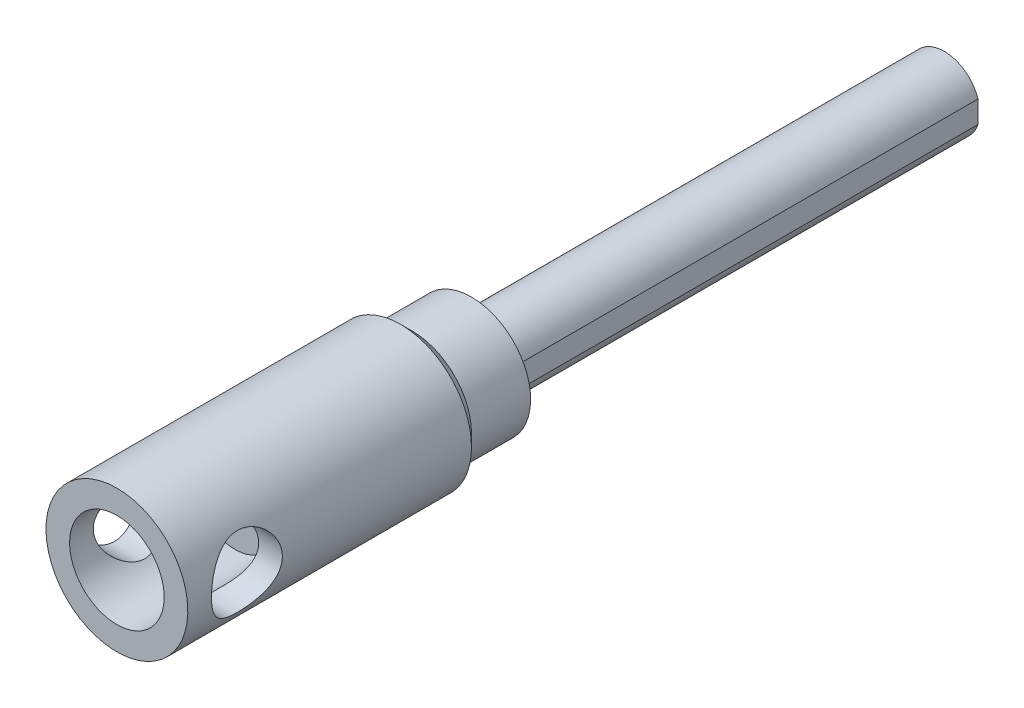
ISO-10303-21;
HEADER;
FILE_DESCRIPTION(('STEP AP214'),'2;1');
FILE_NAME('part.step','',(''),(''),'','','');
FILE_SCHEMA(('AUTOMOTIVE_DESIGN { 1 0 10303 214 1 1 1 1 }'));
ENDSEC;
DATA;
#1=APPLICATION_CONTEXT('core data for automotive mechanical design processes');
#2=APPLICATION_PROTOCOL_DEFINITION('international standard','automotive_design',2000,#1);
#3=PRODUCT_CONTEXT('',#1,'mechanical');
#4=PRODUCT('Part','Part','',(#3));
#5=PRODUCT_RELATED_PRODUCT_CATEGORY('part','',(#4));
#6=PRODUCT_DEFINITION_FORMATION('','',#4);
#7=PRODUCT_DEFINITION_CONTEXT('part definition',#1,'design');
#8=PRODUCT_DEFINITION('design','',#6,#7);
#9=PRODUCT_DEFINITION_SHAPE('','',#8);
#10=(LENGTH_UNIT() NAMED_UNIT(*) SI_UNIT(.MILLI.,.METRE.));
#11=(NAMED_UNIT(*) PLANE_ANGLE_UNIT() SI_UNIT($,.RADIAN.));
#12=(NAMED_UNIT(*) SI_UNIT($,.STERADIAN.) SOLID_ANGLE_UNIT());
#13=UNCERTAINTY_MEASURE_WITH_UNIT(LENGTH_MEASURE(1.E-05),#10,'distance_accuracy_value','');
#14=(GEOMETRIC_REPRESENTATION_CONTEXT(3) GLOBAL_UNCERTAINTY_ASSIGNED_CONTEXT((#13)) GLOBAL_UNIT_ASSIGNED_CONTEXT((#10,
#11,#12)) REPRESENTATION_CONTEXT('',''));
#15=CARTESIAN_POINT('',(0.,0.,0.));
#16=DIRECTION('',(0.,0.,1.));
#17=DIRECTION('',(1.,0.,0.));
#18=AXIS2_PLACEMENT_3D('',#15,#16,#17);
#19=CARTESIAN_POINT('',(-1.73205080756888,8.40265377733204E-13,58.));
#20=DIRECTION('',(0.866025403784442,-0.5,0.));
#21=DIRECTION('',(0.5,0.866025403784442,0.));
#22=AXIS2_PLACEMENT_3D('',#19,#20,#21);
#23=PLANE('',#22);
#24=DIRECTION('',(0.,0.,1.));
#25=VECTOR('',#24,1.);
#26=CARTESIAN_POINT('',(-0.866025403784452,1.50000000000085,58.));
#27=LINE('',#26,#25);
#28=CARTESIAN_POINT('',(-0.866025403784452,1.50000000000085,58.));
#29=VERTEX_POINT('',#28);
#30=CARTESIAN_POINT('',(-0.866025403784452,1.50000000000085,60.));
#31=VERTEX_POINT('',#30);
#32=EDGE_CURVE('E257',#29,#31,#27,.T.);
#33=ORIENTED_EDGE('',*,*,#32,.T.);
#34=DIRECTION('',(0.5,0.866025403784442,0.));
#35=VECTOR('',#34,1.);
#36=CARTESIAN_POINT('',(-1.73205080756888,8.4049667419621E-13,60.));
#37=LINE('',#36,#35);
#38=CARTESIAN_POINT('',(-1.73205080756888,8.4060509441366E-13,60.));
#39=VERTEX_POINT('',#38);
#40=EDGE_CURVE('E29',#39,#31,#37,.T.);
#41=ORIENTED_EDGE('',*,*,#40,.F.);
#42=DIRECTION('',(0.,0.,1.));
#43=VECTOR('',#42,1.);
#44=CARTESIAN_POINT('',(-1.73205080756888,8.40265377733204E-13,58.));
#45=LINE('',#44,#43);
#46=CARTESIAN_POINT('',(-1.73205080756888,8.40265377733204E-13,58.));
#47=VERTEX_POINT('',#46);
#48=EDGE_CURVE('E33',#47,#39,#45,.T.);
#49=ORIENTED_EDGE('',*,*,#48,.F.);
#50=DIRECTION('',(0.5,0.866025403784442,0.));
#51=VECTOR('',#50,1.);
#52=CARTESIAN_POINT('',(-1.73205080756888,8.40265377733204E-13,58.));
#53=LINE('',#52,#51);
#54=EDGE_CURVE('E218',#47,#29,#53,.T.);
#55=ORIENTED_EDGE('',*,*,#54,.T.);
#56=EDGE_LOOP('',(#33,#41,#49,#55));
#57=FACE_BOUND('',#56,.T.);
#58=ADVANCED_FACE('F14',(#57),#23,.T.);
#59=CARTESIAN_POINT('',(0.86602540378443,1.50000000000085,58.));
#60=DIRECTION('',(0.,1.,0.));
#61=DIRECTION('',(-1.,0.,0.));
#62=AXIS2_PLACEMENT_3D('',#59,#60,#61);
#63=PLANE('',#62);
#64=DIRECTION('',(0.,0.,1.));
#65=VECTOR('',#64,1.);
#66=CARTESIAN_POINT('',(0.86602540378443,1.50000000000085,58.));
#67=LINE('',#66,#65);
#68=CARTESIAN_POINT('',(0.86602540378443,1.50000000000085,58.));
#69=VERTEX_POINT('',#68);
#70=CARTESIAN_POINT('',(0.86602540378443,1.50000000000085,60.));
#71=VERTEX_POINT('',#70);
#72=EDGE_CURVE('E255',#69,#71,#67,.T.);
#73=ORIENTED_EDGE('',*,*,#72,.T.);
#74=DIRECTION('',(-1.,0.,0.));
#75=VECTOR('',#74,1.);
#76=CARTESIAN_POINT('',(0.86602540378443,1.50000000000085,60.));
#77=LINE('',#76,#75);
#78=EDGE_CURVE('E230',#71,#31,#77,.T.);
#79=ORIENTED_EDGE('',*,*,#78,.T.);
#80=ORIENTED_EDGE('',*,*,#32,.F.);
#81=DIRECTION('',(-1.,0.,0.));
#82=VECTOR('',#81,1.);
#83=CARTESIAN_POINT('',(0.86602540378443,1.50000000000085,58.));
#84=LINE('',#83,#82);
#85=EDGE_CURVE('E220',#69,#29,#84,.T.);
#86=ORIENTED_EDGE('',*,*,#85,.F.);
#87=EDGE_LOOP('',(#73,#79,#80,#86));
#88=FACE_BOUND('',#87,.T.);
#89=ADVANCED_FACE('F172',(#88),#63,.F.);
#90=CARTESIAN_POINT('',(1.73205080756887,8.54675106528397E-13,58.));
#91=DIRECTION('',(0.866025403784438,0.5,0.));
#92=DIRECTION('',(-0.5,0.866025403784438,0.));
#93=AXIS2_PLACEMENT_3D('',#90,#91,#92);
#94=PLANE('',#93);
#95=DIRECTION('',(0.,0.,1.));
#96=VECTOR('',#95,1.);
#97=CARTESIAN_POINT('',(1.73205080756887,8.54675106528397E-13,58.));
#98=LINE('',#97,#96);
#99=CARTESIAN_POINT('',(1.73205080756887,8.54675106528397E-13,58.));
#100=VERTEX_POINT('',#99);
#101=CARTESIAN_POINT('',(1.73205080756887,8.54906402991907E-13,60.));
#102=VERTEX_POINT('',#101);
#103=EDGE_CURVE('E253',#100,#102,#98,.T.);
#104=ORIENTED_EDGE('',*,*,#103,.T.);
#105=DIRECTION('',(-0.5,0.866025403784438,0.));
#106=VECTOR('',#105,1.);
#107=CARTESIAN_POINT('',(1.73205080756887,8.54906402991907E-13,60.));
#108=LINE('',#107,#106);
#109=EDGE_CURVE('E227',#102,#71,#108,.T.);
#110=ORIENTED_EDGE('',*,*,#109,.T.);
#111=ORIENTED_EDGE('',*,*,#72,.F.);
#112=DIRECTION('',(-0.5,0.866025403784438,0.));
#113=VECTOR('',#112,1.);
#114=CARTESIAN_POINT('',(1.73205080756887,8.54675106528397E-13,58.));
#115=LINE('',#114,#113);
#116=EDGE_CURVE('E243',#100,#69,#115,.T.);
#117=ORIENTED_EDGE('',*,*,#116,.F.);
#118=EDGE_LOOP('',(#104,#110,#111,#117));
#119=FACE_BOUND('',#118,.T.);
#120=ADVANCED_FACE('F177',(#119),#94,.F.);
#121=CARTESIAN_POINT('',(1.73205080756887,8.54675106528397E-13,58.));
#122=DIRECTION('',(-0.866025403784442,0.5,0.));
#123=DIRECTION('',(-0.5,-0.866025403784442,0.));
#124=AXIS2_PLACEMENT_3D('',#121,#122,#123);
#125=PLANE('',#124);
#126=DIRECTION('',(0.,0.,1.));
#127=VECTOR('',#126,1.);
#128=CARTESIAN_POINT('',(0.866025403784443,-1.49999999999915,58.));
#129=LINE('',#128,#127);
#130=CARTESIAN_POINT('',(0.866025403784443,-1.49999999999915,58.));
#131=VERTEX_POINT('',#130);
#132=CARTESIAN_POINT('',(0.866025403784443,-1.49999999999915,60.));
#133=VERTEX_POINT('',#132);
#134=EDGE_CURVE('E251',#131,#133,#129,.T.);
#135=ORIENTED_EDGE('',*,*,#134,.T.);
#136=DIRECTION('',(-0.5,-0.866025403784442,0.));
#137=VECTOR('',#136,1.);
#138=CARTESIAN_POINT('',(1.73205080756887,8.54906402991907E-13,60.));
#139=LINE('',#138,#137);
#140=EDGE_CURVE('E222',#102,#133,#139,.T.);
#141=ORIENTED_EDGE('',*,*,#140,.F.);
#142=ORIENTED_EDGE('',*,*,#103,.F.);
#143=DIRECTION('',(-0.5,-0.866025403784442,0.));
#144=VECTOR('',#143,1.);
#145=CARTESIAN_POINT('',(1.73205080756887,8.54675106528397E-13,58.));
#146=LINE('',#145,#144);
#147=EDGE_CURVE('E240',#100,#131,#146,.T.);
#148=ORIENTED_EDGE('',*,*,#147,.T.);
#149=EDGE_LOOP('',(#135,#141,#142,#148));
#150=FACE_BOUND('',#149,.T.);
#151=ADVANCED_FACE('F189',(#150),#125,.T.);
#152=CARTESIAN_POINT('',(-0.866025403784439,-1.49999999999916,58.));
#153=DIRECTION('',(0.,-1.,0.));
#154=DIRECTION('',(1.,0.,0.));
#155=AXIS2_PLACEMENT_3D('',#152,#153,#154);
#156=PLANE('',#155);
#157=DIRECTION('',(0.,0.,1.));
#158=VECTOR('',#157,1.);
#159=CARTESIAN_POINT('',(-0.866025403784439,-1.49999999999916,58.));
#160=LINE('',#159,#158);
#161=CARTESIAN_POINT('',(-0.866025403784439,-1.49999999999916,58.));
#162=VERTEX_POINT('',#161);
#163=CARTESIAN_POINT('',(-0.866025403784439,-1.49999999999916,60.));
#164=VERTEX_POINT('',#163);
#165=EDGE_CURVE('E249',#162,#164,#160,.T.);
#166=ORIENTED_EDGE('',*,*,#165,.T.);
#167=DIRECTION('',(1.,0.,0.));
#168=VECTOR('',#167,1.);
#169=CARTESIAN_POINT('',(-0.866025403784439,-1.49999999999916,60.));
#170=LINE('',#169,#168);
#171=EDGE_CURVE('E217',#164,#133,#170,.T.);
#172=ORIENTED_EDGE('',*,*,#171,.T.);
#173=ORIENTED_EDGE('',*,*,#134,.F.);
#174=DIRECTION('',(1.,0.,0.));
#175=VECTOR('',#174,1.);
#176=CARTESIAN_POINT('',(-0.866025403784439,-1.49999999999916,58.));
#177=LINE('',#176,#175);
#178=EDGE_CURVE('E237',#162,#131,#177,.T.);
#179=ORIENTED_EDGE('',*,*,#178,.F.);
#180=EDGE_LOOP('',(#166,#172,#173,#179));
#181=FACE_BOUND('',#180,.T.);
#182=ADVANCED_FACE('F185',(#181),#156,.F.);
#183=CARTESIAN_POINT('',(-1.73205080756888,8.40265377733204E-13,58.));
#184=DIRECTION('',(-0.866025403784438,-0.5,0.));
#185=DIRECTION('',(0.5,-0.866025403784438,0.));
#186=AXIS2_PLACEMENT_3D('',#183,#184,#185);
#187=PLANE('',#186);
#188=DIRECTION('',(0.5,-0.866025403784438,0.));
#189=VECTOR('',#188,1.);
#190=CARTESIAN_POINT('',(-1.73205080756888,8.40265377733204E-13,58.));
#191=LINE('',#190,#189);
#192=EDGE_CURVE('E234',#47,#162,#191,.T.);
#193=ORIENTED_EDGE('',*,*,#192,.F.);
#194=ORIENTED_EDGE('',*,*,#48,.T.);
#195=DIRECTION('',(0.5,-0.866025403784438,0.));
#196=VECTOR('',#195,1.);
#197=CARTESIAN_POINT('',(-1.73205080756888,8.4049667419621E-13,60.));
#198=LINE('',#197,#196);
#199=EDGE_CURVE('E213',#39,#164,#198,.T.);
#200=ORIENTED_EDGE('',*,*,#199,.T.);
#201=ORIENTED_EDGE('',*,*,#165,.F.);
#202=EDGE_LOOP('',(#193,#194,#200,#201));
#203=FACE_BOUND('',#202,.T.);
#204=ADVANCED_FACE('F182',(#203),#187,.F.);
#205=CARTESIAN_POINT('',(-0.866025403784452,1.50000000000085,58.));
#206=DIRECTION('',(0.,0.,1.));
#207=DIRECTION('',(0.,1.,0.));
#208=AXIS2_PLACEMENT_3D('',#205,#206,#207);
#209=PLANE('',#208);
#210=ORIENTED_EDGE('',*,*,#54,.F.);
#211=ORIENTED_EDGE('',*,*,#192,.T.);
#212=ORIENTED_EDGE('',*,*,#178,.T.);
#213=ORIENTED_EDGE('',*,*,#147,.F.);
#214=ORIENTED_EDGE('',*,*,#116,.T.);
#215=ORIENTED_EDGE('',*,*,#85,.T.);
#216=EDGE_LOOP('',(#210,#211,#212,#213,#214,#215));
#217=FACE_BOUND('',#216,.T.);
#218=ADVANCED_FACE('F181',(#217),#209,.T.);
#219=CARTESIAN_POINT('',(0.,8.47701538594E-13,60.));
#220=DIRECTION('',(0.,0.,1.));
#221=DIRECTION('',(0.,1.,0.));
#222=AXIS2_PLACEMENT_3D('',#219,#220,#221);
#223=PLANE('',#222);
#224=CARTESIAN_POINT('',(0.,8.47701538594E-13,60.));
#225=DIRECTION('',(0.,0.,1.));
#226=DIRECTION('',(0.,1.,0.));
#227=AXIS2_PLACEMENT_3D('',#224,#225,#226);
#228=CIRCLE('',#227,3.5);
#229=CARTESIAN_POINT('',(0.,3.50000000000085,60.));
#230=VERTEX_POINT('',#229);
#231=EDGE_CURVE('E9',#230,#230,#228,.T.);
#232=ORIENTED_EDGE('',*,*,#231,.T.);
#233=EDGE_LOOP('',(#232));
#234=FACE_BOUND('',#233,.T.);
#235=ORIENTED_EDGE('',*,*,#199,.F.);
#236=ORIENTED_EDGE('',*,*,#40,.T.);
#237=ORIENTED_EDGE('',*,*,#78,.F.);
#238=ORIENTED_EDGE('',*,*,#109,.F.);
#239=ORIENTED_EDGE('',*,*,#140,.T.);
#240=ORIENTED_EDGE('',*,*,#171,.F.);
#241=EDGE_LOOP('',(#235,#236,#237,#238,#239,#240));
#242=FACE_BOUND('',#241,.T.);
#243=ADVANCED_FACE('F16',(#234,#242),#223,.T.);
#244=CARTESIAN_POINT('',(0.,8.48164131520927E-13,64.));
#245=DIRECTION('',(0.,0.,1.));
#246=DIRECTION('',(0.,1.,0.));
#247=AXIS2_PLACEMENT_3D('',#244,#245,#246);
#248=CYLINDRICAL_SURFACE('',#247,3.5);
#249=CARTESIAN_POINT('',(0.,8.47238945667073E-13,56.));
#250=DIRECTION('',(0.,0.,1.));
#251=DIRECTION('',(0.,1.,0.));
#252=AXIS2_PLACEMENT_3D('',#249,#250,#251);
#253=CIRCLE('',#252,3.5);
#254=CARTESIAN_POINT('',(0.,3.50000000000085,56.));
#255=VERTEX_POINT('',#254);
#256=EDGE_CURVE('E22',#255,#255,#253,.T.);
#257=ORIENTED_EDGE('',*,*,#256,.T.);
#258=EDGE_LOOP('',(#257));
#259=FACE_BOUND('',#258,.T.);
#260=ORIENTED_EDGE('',*,*,#231,.F.);
#261=EDGE_LOOP('',(#260));
#262=FACE_BOUND('',#261,.T.);
#263=ADVANCED_FACE('F196',(#259,#262),#248,.T.);
#264=CARTESIAN_POINT('',(3.,0.,0.));
#265=DIRECTION('',(0.,0.,-1.));
#266=DIRECTION('',(1.,0.,0.));
#267=AXIS2_PLACEMENT_3D('',#264,#265,#266);
#268=PLANE('',#267);
#269=DIRECTION('',(0.,-1.,0.));
#270=VECTOR('',#269,1.);
#271=CARTESIAN_POINT('',(2.85,-0.93674969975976,0.));
#272=LINE('',#271,#270);
#273=CARTESIAN_POINT('',(2.85,0.936749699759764,0.));
#274=VERTEX_POINT('',#273);
#275=CARTESIAN_POINT('',(2.85,-0.936749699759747,0.));
#276=VERTEX_POINT('',#275);
#277=EDGE_CURVE('E78',#274,#276,#272,.T.);
#278=ORIENTED_EDGE('',*,*,#277,.T.);
#279=CARTESIAN_POINT('',(0.,0.,0.));
#280=DIRECTION('',(0.,0.,-1.));
#281=DIRECTION('',(1.,0.,0.));
#282=AXIS2_PLACEMENT_3D('',#279,#280,#281);
#283=CIRCLE('',#282,3.);
#284=EDGE_CURVE('E91',#276,#274,#283,.T.);
#285=ORIENTED_EDGE('',*,*,#284,.T.);
#286=EDGE_LOOP('',(#278,#285));
#287=FACE_BOUND('',#286,.T.);
#288=ADVANCED_FACE('F95',(#287),#268,.T.);
#289=CARTESIAN_POINT('',(0.,0.,0.));
#290=DIRECTION('',(0.,0.,-1.));
#291=DIRECTION('',(1.,0.,0.));
#292=AXIS2_PLACEMENT_3D('',#289,#290,#291);
#293=CYLINDRICAL_SURFACE('',#292,3.);
#294=CARTESIAN_POINT('',(0.,0.,40.));
#295=DIRECTION('',(0.,0.,1.));
#296=DIRECTION('',(1.,-2.05102760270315E-10,0.));
#297=AXIS2_PLACEMENT_3D('',#294,#295,#296);
#298=CIRCLE('',#297,3.);
#299=CARTESIAN_POINT('',(2.85,0.936749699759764,40.));
#300=VERTEX_POINT('',#299);
#301=CARTESIAN_POINT('',(2.85,-0.93674969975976,40.));
#302=VERTEX_POINT('',#301);
#303=EDGE_CURVE('E93',#300,#302,#298,.T.);
#304=ORIENTED_EDGE('',*,*,#303,.F.);
#305=DIRECTION('',(0.,0.,1.));
#306=VECTOR('',#305,1.);
#307=CARTESIAN_POINT('',(2.85,0.936749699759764,0.));
#308=LINE('',#307,#306);
#309=EDGE_CURVE('E81',#274,#300,#308,.T.);
#310=ORIENTED_EDGE('',*,*,#309,.F.);
#311=ORIENTED_EDGE('',*,*,#284,.F.);
#312=DIRECTION('',(0.,0.,1.));
#313=VECTOR('',#312,1.);
#314=CARTESIAN_POINT('',(2.85,-0.93674969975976,0.));
#315=LINE('',#314,#313);
#316=EDGE_CURVE('E83',#276,#302,#315,.T.);
#317=ORIENTED_EDGE('',*,*,#316,.T.);
#318=EDGE_LOOP('',(#304,#310,#311,#317));
#319=FACE_BOUND('',#318,.T.);
#320=ADVANCED_FACE('F90',(#319),#293,.T.);
#321=CARTESIAN_POINT('',(2.85,-0.93674969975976,0.));
#322=DIRECTION('',(-1.,0.,0.));
#323=DIRECTION('',(0.,-1.,0.));
#324=AXIS2_PLACEMENT_3D('',#321,#322,#323);
#325=PLANE('',#324);
#326=ORIENTED_EDGE('',*,*,#309,.T.);
#327=DIRECTION('',(0.,-1.,0.));
#328=VECTOR('',#327,1.);
#329=CARTESIAN_POINT('',(2.85,5.0000000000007,40.));
#330=LINE('',#329,#328);
#331=EDGE_CURVE('E389',#300,#302,#330,.T.);
#332=ORIENTED_EDGE('',*,*,#331,.T.);
#333=ORIENTED_EDGE('',*,*,#316,.F.);
#334=ORIENTED_EDGE('',*,*,#277,.F.);
#335=EDGE_LOOP('',(#326,#332,#333,#334));
#336=FACE_BOUND('',#335,.T.);
#337=ADVANCED_FACE('F80',(#336),#325,.F.);
#338=CARTESIAN_POINT('',(0.,5.00000000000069,40.));
#339=DIRECTION('',(0.,0.,1.));
#340=DIRECTION('',(0.,-1.,0.));
#341=AXIS2_PLACEMENT_3D('',#338,#339,#340);
#342=PLANE('',#341);
#343=ORIENTED_EDGE('',*,*,#331,.F.);
#344=ORIENTED_EDGE('',*,*,#303,.T.);
#345=EDGE_LOOP('',(#343,#344));
#346=FACE_BOUND('',#345,.T.);
#347=CARTESIAN_POINT('',(0.,8.45388573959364E-13,40.));
#348=DIRECTION('',(0.,0.,-1.));
#349=DIRECTION('',(0.,1.,0.));
#350=AXIS2_PLACEMENT_3D('',#347,#348,#349);
#351=CIRCLE('',#350,4.99999999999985);
#352=CARTESIAN_POINT('',(0.,5.0000000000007,40.));
#353=VERTEX_POINT('',#352);
#354=EDGE_CURVE('E383',#353,#353,#351,.T.);
#355=ORIENTED_EDGE('',*,*,#354,.T.);
#356=EDGE_LOOP('',(#355));
#357=FACE_BOUND('',#356,.T.);
#358=ADVANCED_FACE('F156',(#346,#357),#342,.F.);
#359=CARTESIAN_POINT('',(0.,8.42416414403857E-13,14.3));
#360=DIRECTION('',(0.,0.,-1.));
#361=DIRECTION('',(0.,1.,0.));
#362=AXIS2_PLACEMENT_3D('',#359,#360,#361);
#363=CYLINDRICAL_SURFACE('',#362,4.99999999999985);
#364=ORIENTED_EDGE('',*,*,#354,.F.);
#365=EDGE_LOOP('',(#364));
#366=FACE_BOUND('',#365,.T.);
#367=CARTESIAN_POINT('',(0.,8.45966815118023E-13,45.));
#368=DIRECTION('',(0.,0.,-1.));
#369=DIRECTION('',(0.,1.,0.));
#370=AXIS2_PLACEMENT_3D('',#367,#368,#369);
#371=CIRCLE('',#370,4.99999999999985);
#372=CARTESIAN_POINT('',(0.,5.0000000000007,45.));
#373=VERTEX_POINT('',#372);
#374=EDGE_CURVE('E385',#373,#373,#371,.T.);
#375=ORIENTED_EDGE('',*,*,#374,.T.);
#376=EDGE_LOOP('',(#375));
#377=FACE_BOUND('',#376,.T.);
#378=ADVANCED_FACE('F158',(#366,#377),#363,.T.);
#379=CARTESIAN_POINT('',(0.,8.45966815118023E-13,45.));
#380=DIRECTION('',(0.,0.,1.));
#381=DIRECTION('',(0.,-1.,0.));
#382=AXIS2_PLACEMENT_3D('',#379,#380,#381);
#383=CONICAL_SURFACE('',#382,5.,0.785398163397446);
#384=CARTESIAN_POINT('',(0.,8.46082463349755E-13,46.));
#385=DIRECTION('',(0.,0.,1.));
#386=DIRECTION('',(0.,-1.,0.));
#387=AXIS2_PLACEMENT_3D('',#384,#385,#386);
#388=CIRCLE('',#387,6.);
#389=CARTESIAN_POINT('',(0.,-5.99999999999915,46.));
#390=VERTEX_POINT('',#389);
#391=EDGE_CURVE('E145',#390,#390,#388,.T.);
#392=ORIENTED_EDGE('',*,*,#391,.F.);
#393=EDGE_LOOP('',(#392));
#394=FACE_BOUND('',#393,.T.);
#395=ORIENTED_EDGE('',*,*,#374,.F.);
#396=EDGE_LOOP('',(#395));
#397=FACE_BOUND('',#396,.T.);
#398=ADVANCED_FACE('F128',(#394,#397),#383,.T.);
#399=CARTESIAN_POINT('',(0.,8.42416414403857E-13,14.3));
#400=DIRECTION('',(0.,0.,-1.));
#401=DIRECTION('',(0.,1.,0.));
#402=AXIS2_PLACEMENT_3D('',#399,#400,#401);
#403=CYLINDRICAL_SURFACE('',#402,6.);
#404=ORIENTED_EDGE('',*,*,#391,.T.);
#405=EDGE_LOOP('',(#404));
#406=FACE_BOUND('',#405,.T.);
#407=CARTESIAN_POINT('',(-6.,8.23668342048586E-13,68.));
#408=CARTESIAN_POINT('',(-5.99999934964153,-0.0788941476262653,67.9999991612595));
#409=CARTESIAN_POINT('',(-5.99843869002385,-0.157796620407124,67.9968820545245));
#410=CARTESIAN_POINT('',(-5.99224358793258,-0.315001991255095,67.98446072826));
#411=CARTESIAN_POINT('',(-5.98760776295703,-0.393304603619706,67.9751537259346));
#412=CARTESIAN_POINT('',(-5.96921978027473,-0.626628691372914,67.9380421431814));
#413=CARTESIAN_POINT('',(-5.95098734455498,-0.779952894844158,67.9010471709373));
#414=CARTESIAN_POINT('',(-5.90448966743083,-1.07683586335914,67.8044182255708));
#415=CARTESIAN_POINT('',(-5.87626344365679,-1.22043005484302,67.7448722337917));
#416=CARTESIAN_POINT('',(-5.81237302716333,-1.49540820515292,67.6052887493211));
#417=CARTESIAN_POINT('',(-5.77670942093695,-1.62679312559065,67.5252528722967));
#418=CARTESIAN_POINT('',(-5.69868752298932,-1.88252701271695,67.3414460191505));
#419=CARTESIAN_POINT('',(-5.65605474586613,-2.00596945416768,67.2365320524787));
#420=CARTESIAN_POINT('',(-5.5698003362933,-2.23433451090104,67.0084440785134));
#421=CARTESIAN_POINT('',(-5.5261779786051,-2.33924301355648,66.8852562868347));
#422=CARTESIAN_POINT('',(-5.43896347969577,-2.53576864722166,66.6125156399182));
#423=CARTESIAN_POINT('',(-5.39563602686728,-2.62572411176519,66.4616590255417));
#424=CARTESIAN_POINT('',(-5.33782449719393,-2.74034031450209,66.2240491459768));
#425=CARTESIAN_POINT('',(-5.31974570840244,-2.77516786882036,66.1429290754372));
#426=CARTESIAN_POINT('',(-5.28665768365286,-2.83769299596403,65.9773994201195));
#427=CARTESIAN_POINT('',(-5.27164663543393,-2.86539478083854,65.8929918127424));
#428=CARTESIAN_POINT('',(-5.24610341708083,-2.91188280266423,65.7266042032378));
#429=CARTESIAN_POINT('',(-5.23535838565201,-2.93110042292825,65.6447772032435));
#430=CARTESIAN_POINT('',(-5.21757784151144,-2.96263559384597,65.4794450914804));
#431=CARTESIAN_POINT('',(-5.21054036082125,-2.97495680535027,65.3959408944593));
#432=CARTESIAN_POINT('',(-5.20047756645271,-2.99251382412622,65.2279936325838));
#433=CARTESIAN_POINT('',(-5.19744983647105,-2.99775389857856,65.1435511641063));
#434=CARTESIAN_POINT('',(-5.19552555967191,-3.00108452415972,64.9745063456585));
#435=CARTESIAN_POINT('',(-5.19662861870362,-2.99917575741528,64.8899040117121));
#436=CARTESIAN_POINT('',(-5.20534668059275,-2.98404973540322,64.6572461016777));
#437=CARTESIAN_POINT('',(-5.21726794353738,-2.96335042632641,64.5097558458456));
#438=CARTESIAN_POINT('',(-5.25228182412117,-2.90082280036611,64.220806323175));
#439=CARTESIAN_POINT('',(-5.2753780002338,-2.85898775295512,64.0793489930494));
#440=CARTESIAN_POINT('',(-5.33062568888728,-2.75462843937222,63.8023203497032));
#441=CARTESIAN_POINT('',(-5.36297559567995,-2.69164495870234,63.6669628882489));
#442=CARTESIAN_POINT('',(-5.43310175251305,-2.54712530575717,63.408095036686));
#443=CARTESIAN_POINT('',(-5.4708804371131,-2.46558080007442,63.2845900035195));
#444=CARTESIAN_POINT('',(-5.55339485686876,-2.27419808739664,63.0364369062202));
#445=CARTESIAN_POINT('',(-5.59840533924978,-2.16208335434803,62.9136295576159));
#446=CARTESIAN_POINT('',(-5.68642866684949,-1.91866675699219,62.687793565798));
#447=CARTESIAN_POINT('',(-5.72944054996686,-1.78735577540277,62.5847743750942));
#448=CARTESIAN_POINT('',(-5.81105962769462,-1.50154951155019,62.3969430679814));
#449=CARTESIAN_POINT('',(-5.84936952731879,-1.34626077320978,62.3131985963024));
#450=CARTESIAN_POINT('',(-5.91473643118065,-1.02139864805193,62.1737088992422));
#451=CARTESIAN_POINT('',(-5.94180236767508,-0.851836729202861,62.1179414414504));
#452=CARTESIAN_POINT('',(-5.97973001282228,-0.51829947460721,62.0405737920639));
#453=CARTESIAN_POINT('',(-5.99174814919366,-0.355024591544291,62.0165262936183));
#454=CARTESIAN_POINT('',(-6.00219040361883,-0.0263387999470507,61.9956058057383));
#455=CARTESIAN_POINT('',(-6.00062096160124,0.139071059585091,61.9987199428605));
#456=CARTESIAN_POINT('',(-5.98473576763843,0.45369891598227,62.0306200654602));
#457=CARTESIAN_POINT('',(-5.97141737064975,0.603178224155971,62.0573975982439));
#458=CARTESIAN_POINT('',(-5.93466513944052,0.895220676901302,62.1327142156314));
#459=CARTESIAN_POINT('',(-5.91123019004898,1.03778305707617,62.1812556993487));
#460=CARTESIAN_POINT('',(-5.85552754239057,1.3166658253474,62.2999953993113));
#461=CARTESIAN_POINT('',(-5.82302645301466,1.45269119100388,62.3707731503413));
#462=CARTESIAN_POINT('',(-5.75231922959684,1.71138408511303,62.5313226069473));
#463=CARTESIAN_POINT('',(-5.71411066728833,1.83404588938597,62.6211024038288));
#464=CARTESIAN_POINT('',(-5.63124663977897,2.07530306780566,62.8272812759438));
#465=CARTESIAN_POINT('',(-5.58632654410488,2.19231623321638,62.9454286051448));
#466=CARTESIAN_POINT('',(-5.49787174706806,2.40556896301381,63.1997754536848));
#467=CARTESIAN_POINT('',(-5.45433802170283,2.50179415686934,63.3359873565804));
#468=CARTESIAN_POINT('',(-5.37153576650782,2.67512374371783,63.6309309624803));
#469=CARTESIAN_POINT('',(-5.33257588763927,2.75107648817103,63.7904337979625));
#470=CARTESIAN_POINT('',(-5.26722216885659,2.87424847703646,64.1225302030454));
#471=CARTESIAN_POINT('',(-5.24081214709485,2.9215047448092,64.2951065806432));
#472=CARTESIAN_POINT('',(-5.20684503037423,2.98158506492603,64.6307306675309));
#473=CARTESIAN_POINT('',(-5.19772150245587,2.99727899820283,64.7931027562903));
#474=CARTESIAN_POINT('',(-5.19496064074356,3.00206745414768,65.1183412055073));
#475=CARTESIAN_POINT('',(-5.2013165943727,2.99117350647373,65.2812073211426));
#476=CARTESIAN_POINT('',(-5.22713585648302,2.94577840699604,65.5864504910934));
#477=CARTESIAN_POINT('',(-5.24529281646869,2.9136250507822,65.7293013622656));
#478=CARTESIAN_POINT('',(-5.29113050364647,2.82952596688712,66.0074244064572));
#479=CARTESIAN_POINT('',(-5.31881429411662,2.77757387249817,66.1426941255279));
#480=CARTESIAN_POINT('',(-5.38285583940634,2.6514476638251,66.4118743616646));
#481=CARTESIAN_POINT('',(-5.41967139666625,2.57601505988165,66.5450829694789));
#482=CARTESIAN_POINT('',(-5.49706022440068,2.40645126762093,66.7978243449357));
#483=CARTESIAN_POINT('',(-5.53763544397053,2.31231035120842,66.9173499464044));
#484=CARTESIAN_POINT('',(-5.6238685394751,2.09461689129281,67.154422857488));
#485=CARTESIAN_POINT('',(-5.66954494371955,1.9688805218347,67.2699651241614));
#486=CARTESIAN_POINT('',(-5.75633712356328,1.69843715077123,67.478801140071));
#487=CARTESIAN_POINT('',(-5.79745043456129,1.55371998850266,67.5720828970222));
#488=CARTESIAN_POINT('',(-5.85251406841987,1.32452333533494,67.6931781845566));
#489=CARTESIAN_POINT('',(-5.86982524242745,1.2457531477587,67.7305202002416));
#490=CARTESIAN_POINT('',(-5.90168845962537,1.08479725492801,67.7983616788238));
#491=CARTESIAN_POINT('',(-5.91624185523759,1.00261324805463,67.8288644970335));
#492=CARTESIAN_POINT('',(-5.94212690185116,0.835616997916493,67.8826072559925));
#493=CARTESIAN_POINT('',(-5.9534655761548,0.750810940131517,67.905863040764));
#494=CARTESIAN_POINT('',(-5.9726077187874,0.579142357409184,67.9448825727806));
#495=CARTESIAN_POINT('',(-5.98041334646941,0.492281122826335,67.9606508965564));
#496=CARTESIAN_POINT('',(-5.99085829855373,0.337824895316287,67.9816846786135));
#497=CARTESIAN_POINT('',(-5.99428035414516,0.270495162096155,67.9885469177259));
#498=CARTESIAN_POINT('',(-5.99885151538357,0.135445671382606,67.9977050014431));
#499=CARTESIAN_POINT('',(-6.00000055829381,0.0677259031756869,68.0000007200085));
#500=CARTESIAN_POINT('',(-6.,8.23668342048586E-13,68.));
#501=B_SPLINE_CURVE_WITH_KNOTS('',3,(#407,#408,#409,#410,#411,#412,#413,#414,#415,#416,#417,
#418,#419,#420,#421,#422,#423,#424,#425,#426,#427,#428,#429,#430,#431,#432,#433,#434,#435,#436,
#437,#438,#439,#440,#441,#442,#443,#444,#445,#446,#447,#448,#449,#450,#451,#452,#453,#454,#455,
#456,#457,#458,#459,#460,#461,#462,#463,#464,#465,#466,#467,#468,#469,#470,#471,#472,#473,#474,
#475,#476,#477,#478,#479,#480,#481,#482,#483,#484,#485,#486,#487,#488,#489,#490,#491,#492,#493,
#494,#495,#496,#497,#498,#499,#500),.UNSPECIFIED.,.T.,.F.,(4,2,2,2,2,2,2,2,2,2,2,2,2,2,2,2,2,2,
2,2,2,2,2,2,2,2,2,2,2,2,2,2,2,2,2,2,2,2,2,2,2,2,2,2,2,2,4),(0.,0.236611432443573,
0.473329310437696,0.947100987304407,1.41904300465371,1.89094781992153,2.39140181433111,
2.89223525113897,3.43190833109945,3.7019271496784,3.97178599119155,4.22563720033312,
4.47935352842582,4.73291689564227,4.98645606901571,5.43238672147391,5.87845946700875,
6.33492255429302,6.79159098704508,7.30616358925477,7.82098138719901,8.35970601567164,
8.89800185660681,9.39171406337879,9.88519228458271,10.3404225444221,10.7957029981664,
11.2640010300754,11.7324988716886,12.2470036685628,12.7618630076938,13.3016558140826,
13.8407507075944,14.3280945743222,14.8152271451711,15.2559532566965,15.6968212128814,
16.1673090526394,16.6380421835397,17.1659726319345,17.6941868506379,17.9605054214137,
18.2266930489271,18.4922945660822,18.7577335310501,18.9608446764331,19.1639614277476),.UNSPECIFIED.);
#502=CARTESIAN_POINT('',(-6.,8.23668342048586E-13,68.));
#503=VERTEX_POINT('',#502);
#504=EDGE_CURVE('E111',#503,#503,#501,.T.);
#505=ORIENTED_EDGE('',*,*,#504,.T.);
#506=EDGE_LOOP('',(#505));
#507=FACE_BOUND('',#506,.T.);
#508=CARTESIAN_POINT('',(6.,8.73585106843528E-13,68.));
#509=CARTESIAN_POINT('',(5.99999934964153,0.078894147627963,67.9999991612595));
#510=CARTESIAN_POINT('',(5.99843869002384,0.157796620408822,67.9968820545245));
#511=CARTESIAN_POINT('',(5.99224358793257,0.315001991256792,67.98446072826));
#512=CARTESIAN_POINT('',(5.98760776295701,0.393304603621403,67.9751537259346));
#513=CARTESIAN_POINT('',(5.96921978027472,0.62662869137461,67.9380421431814));
#514=CARTESIAN_POINT('',(5.95098734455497,0.779952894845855,67.9010471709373));
#515=CARTESIAN_POINT('',(5.90448966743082,1.07683586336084,67.8044182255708));
#516=CARTESIAN_POINT('',(5.87626344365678,1.22043005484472,67.7448722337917));
#517=CARTESIAN_POINT('',(5.81237302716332,1.49540820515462,67.6052887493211));
#518=CARTESIAN_POINT('',(5.77670942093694,1.62679312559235,67.5252528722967));
#519=CARTESIAN_POINT('',(5.69868752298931,1.88252701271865,67.3414460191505));
#520=CARTESIAN_POINT('',(5.65605474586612,2.00596945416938,67.2365320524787));
#521=CARTESIAN_POINT('',(5.56980033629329,2.23433451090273,67.0084440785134));
#522=CARTESIAN_POINT('',(5.5261779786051,2.33924301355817,66.8852562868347));
#523=CARTESIAN_POINT('',(5.43896347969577,2.53576864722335,66.6125156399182));
#524=CARTESIAN_POINT('',(5.39563602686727,2.62572411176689,66.4616590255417));
#525=CARTESIAN_POINT('',(5.33782449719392,2.74034031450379,66.2240491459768));
#526=CARTESIAN_POINT('',(5.31974570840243,2.77516786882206,66.1429290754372));
#527=CARTESIAN_POINT('',(5.28665768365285,2.83769299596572,65.9773994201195));
#528=CARTESIAN_POINT('',(5.27164663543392,2.86539478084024,65.8929918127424));
#529=CARTESIAN_POINT('',(5.24610341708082,2.91188280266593,65.7266042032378));
#530=CARTESIAN_POINT('',(5.23535838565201,2.93110042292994,65.6447772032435));
#531=CARTESIAN_POINT('',(5.21757784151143,2.96263559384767,65.4794450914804));
#532=CARTESIAN_POINT('',(5.21054036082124,2.97495680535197,65.3959408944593));
#533=CARTESIAN_POINT('',(5.2004775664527,2.99251382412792,65.2279936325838));
#534=CARTESIAN_POINT('',(5.19744983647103,2.99775389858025,65.1435511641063));
#535=CARTESIAN_POINT('',(5.1955255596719,3.00108452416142,64.9745063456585));
#536=CARTESIAN_POINT('',(5.19662861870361,2.99917575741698,64.8899040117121));
#537=CARTESIAN_POINT('',(5.20534668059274,2.98404973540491,64.6572461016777));
#538=CARTESIAN_POINT('',(5.21726794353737,2.9633504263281,64.5097558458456));
#539=CARTESIAN_POINT('',(5.25228182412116,2.9008228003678,64.220806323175));
#540=CARTESIAN_POINT('',(5.2753780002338,2.85898775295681,64.0793489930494));
#541=CARTESIAN_POINT('',(5.33062568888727,2.75462843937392,63.8023203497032));
#542=CARTESIAN_POINT('',(5.36297559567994,2.69164495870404,63.6669628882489));
#543=CARTESIAN_POINT('',(5.43310175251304,2.54712530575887,63.408095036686));
#544=CARTESIAN_POINT('',(5.47088043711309,2.46558080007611,63.2845900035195));
#545=CARTESIAN_POINT('',(5.55339485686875,2.27419808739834,63.0364369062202));
#546=CARTESIAN_POINT('',(5.59840533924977,2.16208335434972,62.9136295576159));
#547=CARTESIAN_POINT('',(5.68642866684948,1.91866675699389,62.687793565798));
#548=CARTESIAN_POINT('',(5.72944054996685,1.78735577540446,62.5847743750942));
#549=CARTESIAN_POINT('',(5.81105962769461,1.50154951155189,62.3969430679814));
#550=CARTESIAN_POINT('',(5.84936952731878,1.34626077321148,62.3131985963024));
#551=CARTESIAN_POINT('',(5.91473643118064,1.02139864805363,62.1737088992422));
#552=CARTESIAN_POINT('',(5.94180236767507,0.851836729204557,62.1179414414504));
#553=CARTESIAN_POINT('',(5.97973001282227,0.518299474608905,62.0405737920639));
#554=CARTESIAN_POINT('',(5.99174814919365,0.355024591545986,62.0165262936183));
#555=CARTESIAN_POINT('',(6.00219040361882,0.0263387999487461,61.9956058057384));
#556=CARTESIAN_POINT('',(6.00062096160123,-0.139071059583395,61.9987199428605));
#557=CARTESIAN_POINT('',(5.98473576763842,-0.453698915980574,62.0306200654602));
#558=CARTESIAN_POINT('',(5.97141737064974,-0.603178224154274,62.0573975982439));
#559=CARTESIAN_POINT('',(5.93466513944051,-0.895220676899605,62.1327142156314));
#560=CARTESIAN_POINT('',(5.91123019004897,-1.03778305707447,62.1812556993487));
#561=CARTESIAN_POINT('',(5.85552754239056,-1.3166658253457,62.2999953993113));
#562=CARTESIAN_POINT('',(5.82302645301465,-1.45269119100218,62.3707731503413));
#563=CARTESIAN_POINT('',(5.75231922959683,-1.71138408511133,62.5313226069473));
#564=CARTESIAN_POINT('',(5.71411066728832,-1.83404588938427,62.6211024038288));
#565=CARTESIAN_POINT('',(5.63124663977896,-2.07530306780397,62.8272812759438));
#566=CARTESIAN_POINT('',(5.58632654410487,-2.19231623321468,62.9454286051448));
#567=CARTESIAN_POINT('',(5.49787174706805,-2.40556896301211,63.1997754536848));
#568=CARTESIAN_POINT('',(5.45433802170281,-2.50179415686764,63.3359873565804));
#569=CARTESIAN_POINT('',(5.37153576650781,-2.67512374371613,63.6309309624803));
#570=CARTESIAN_POINT('',(5.33257588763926,-2.75107648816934,63.7904337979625));
#571=CARTESIAN_POINT('',(5.26722216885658,-2.87424847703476,64.1225302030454));
#572=CARTESIAN_POINT('',(5.24081214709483,-2.9215047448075,64.2951065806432));
#573=CARTESIAN_POINT('',(5.20684503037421,-2.98158506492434,64.6307306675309));
#574=CARTESIAN_POINT('',(5.19772150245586,-2.99727899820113,64.7931027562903));
#575=CARTESIAN_POINT('',(5.19496064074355,-3.00206745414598,65.1183412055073));
#576=CARTESIAN_POINT('',(5.20131659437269,-2.99117350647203,65.2812073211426));
#577=CARTESIAN_POINT('',(5.22713585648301,-2.94577840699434,65.5864504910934));
#578=CARTESIAN_POINT('',(5.24529281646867,-2.9136250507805,65.7293013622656));
#579=CARTESIAN_POINT('',(5.29113050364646,-2.82952596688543,66.0074244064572));
#580=CARTESIAN_POINT('',(5.31881429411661,-2.77757387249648,66.1426941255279));
#581=CARTESIAN_POINT('',(5.38285583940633,-2.65144766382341,66.4118743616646));
#582=CARTESIAN_POINT('',(5.41967139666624,-2.57601505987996,66.5450829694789));
#583=CARTESIAN_POINT('',(5.49706022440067,-2.40645126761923,66.7978243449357));
#584=CARTESIAN_POINT('',(5.53763544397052,-2.31231035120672,66.9173499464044));
#585=CARTESIAN_POINT('',(5.62386853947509,-2.09461689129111,67.154422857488));
#586=CARTESIAN_POINT('',(5.66954494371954,-1.96888052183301,67.2699651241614));
#587=CARTESIAN_POINT('',(5.75633712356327,-1.69843715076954,67.478801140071));
#588=CARTESIAN_POINT('',(5.79745043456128,-1.55371998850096,67.5720828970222));
#589=CARTESIAN_POINT('',(5.85251406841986,-1.32452333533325,67.6931781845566));
#590=CARTESIAN_POINT('',(5.86982524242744,-1.245753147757,67.7305202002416));
#591=CARTESIAN_POINT('',(5.90168845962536,-1.08479725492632,67.7983616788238));
#592=CARTESIAN_POINT('',(5.91624185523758,-1.00261324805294,67.8288644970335));
#593=CARTESIAN_POINT('',(5.94212690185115,-0.835616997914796,67.8826072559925));
#594=CARTESIAN_POINT('',(5.95346557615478,-0.750810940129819,67.905863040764));
#595=CARTESIAN_POINT('',(5.97260771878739,-0.579142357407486,67.9448825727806));
#596=CARTESIAN_POINT('',(5.9804133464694,-0.492281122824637,67.9606508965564));
#597=CARTESIAN_POINT('',(5.99085829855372,-0.33782489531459,67.9816846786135));
#598=CARTESIAN_POINT('',(5.99428035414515,-0.270495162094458,67.988546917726));
#599=CARTESIAN_POINT('',(5.99885151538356,-0.135445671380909,67.9977050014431));
#600=CARTESIAN_POINT('',(6.00000055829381,-0.0677259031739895,68.0000007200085));
#601=CARTESIAN_POINT('',(6.,8.73585106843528E-13,68.));
#602=B_SPLINE_CURVE_WITH_KNOTS('',3,(#508,#509,#510,#511,#512,#513,#514,#515,#516,#517,#518,
#519,#520,#521,#522,#523,#524,#525,#526,#527,#528,#529,#530,#531,#532,#533,#534,#535,#536,#537,
#538,#539,#540,#541,#542,#543,#544,#545,#546,#547,#548,#549,#550,#551,#552,#553,#554,#555,#556,
#557,#558,#559,#560,#561,#562,#563,#564,#565,#566,#567,#568,#569,#570,#571,#572,#573,#574,#575,
#576,#577,#578,#579,#580,#581,#582,#583,#584,#585,#586,#587,#588,#589,#590,#591,#592,#593,#594,
#595,#596,#597,#598,#599,#600,#601),.UNSPECIFIED.,.T.,.F.,(4,2,2,2,2,2,2,2,2,2,2,2,2,2,2,2,2,2,
2,2,2,2,2,2,2,2,2,2,2,2,2,2,2,2,2,2,2,2,2,2,2,2,2,2,2,2,4),(0.,0.236611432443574,
0.473329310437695,0.947100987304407,1.41904300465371,1.89094781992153,2.39140181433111,
2.89223525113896,3.43190833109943,3.7019271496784,3.97178599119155,4.22563720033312,
4.47935352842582,4.73291689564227,4.98645606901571,5.43238672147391,5.87845946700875,
6.33492255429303,6.79159098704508,7.30616358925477,7.82098138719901,8.35970601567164,
8.89800185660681,9.39171406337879,9.8851922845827,10.3404225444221,10.7957029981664,
11.2640010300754,11.7324988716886,12.2470036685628,12.7618630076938,13.3016558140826,
13.8407507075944,14.3280945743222,14.8152271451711,15.2559532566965,15.6968212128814,
16.1673090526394,16.6380421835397,17.1659726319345,17.6941868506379,17.9605054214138,
18.2266930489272,18.4922945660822,18.7577335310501,18.9608446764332,19.1639614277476),.UNSPECIFIED.);
#603=CARTESIAN_POINT('',(6.,8.73585106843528E-13,68.));
#604=VERTEX_POINT('',#603);
#605=EDGE_CURVE('E103',#604,#604,#602,.T.);
#606=ORIENTED_EDGE('',*,*,#605,.T.);
#607=EDGE_LOOP('',(#606));
#608=FACE_BOUND('',#607,.T.);
#609=CARTESIAN_POINT('',(0.,8.48858020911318E-13,70.));
#610=DIRECTION('',(0.,0.,-1.));
#611=DIRECTION('',(0.,1.,0.));
#612=AXIS2_PLACEMENT_3D('',#609,#610,#611);
#613=CIRCLE('',#612,6.);
#614=CARTESIAN_POINT('',(0.,6.00000000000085,70.));
#615=VERTEX_POINT('',#614);
#616=EDGE_CURVE('E374',#615,#615,#613,.T.);
#617=ORIENTED_EDGE('',*,*,#616,.T.);
#618=EDGE_LOOP('',(#617));
#619=FACE_BOUND('',#618,.T.);
#620=ADVANCED_FACE('F116',(#406,#507,#608,#619),#403,.T.);
#621=CARTESIAN_POINT('',(0.,6.00000000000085,70.));
#622=DIRECTION('',(0.,0.,-1.));
#623=DIRECTION('',(0.,1.,0.));
#624=AXIS2_PLACEMENT_3D('',#621,#622,#623);
#625=PLANE('',#624);
#626=ORIENTED_EDGE('',*,*,#616,.F.);
#627=EDGE_LOOP('',(#626));
#628=FACE_BOUND('',#627,.T.);
#629=CARTESIAN_POINT('',(0.,8.48858020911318E-13,70.));
#630=DIRECTION('',(0.,0.,-1.));
#631=DIRECTION('',(0.,1.,0.));
#632=AXIS2_PLACEMENT_3D('',#629,#630,#631);
#633=CIRCLE('',#632,3.99999999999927);
#634=CARTESIAN_POINT('',(0.,4.00000000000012,70.));
#635=VERTEX_POINT('',#634);
#636=EDGE_CURVE('E375',#635,#635,#633,.T.);
#637=ORIENTED_EDGE('',*,*,#636,.T.);
#638=EDGE_LOOP('',(#637));
#639=FACE_BOUND('',#638,.T.);
#640=ADVANCED_FACE('F130',(#628,#639),#625,.F.);
#641=CARTESIAN_POINT('',(-25.,7.44286519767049E-13,65.));
#642=DIRECTION('',(1.,0.,0.));
#643=DIRECTION('',(0.,0.,1.));
#644=AXIS2_PLACEMENT_3D('',#641,#642,#643);
#645=CYLINDRICAL_SURFACE('',#644,3.);
#646=CARTESIAN_POINT('',(3.99999999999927,8.65265646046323E-13,68.));
#647=CARTESIAN_POINT('',(3.99999929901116,-0.0732613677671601,67.999999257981));
#648=CARTESIAN_POINT('',(3.9979806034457,-0.146542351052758,67.9973094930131));
#649=CARTESIAN_POINT('',(3.98996245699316,-0.292508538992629,67.986605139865));
#650=CARTESIAN_POINT('',(3.98396062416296,-0.365193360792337,67.9785873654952));
#651=CARTESIAN_POINT('',(3.96012745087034,-0.581731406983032,67.9466640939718));
#652=CARTESIAN_POINT('',(3.93646888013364,-0.723892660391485,67.9148890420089));
#653=CARTESIAN_POINT('',(3.87591490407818,-0.998506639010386,67.8325747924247));
#654=CARTESIAN_POINT('',(3.83910000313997,-1.13101263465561,67.7821496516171));
#655=CARTESIAN_POINT('',(3.7550101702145,-1.38483526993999,67.6649146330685));
#656=CARTESIAN_POINT('',(3.70773829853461,-1.5061551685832,67.5981095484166));
#657=CARTESIAN_POINT('',(3.60099357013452,-1.74693213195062,67.4434762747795));
#658=CARTESIAN_POINT('',(3.54079623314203,-1.86517631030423,67.3542741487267));
#659=CARTESIAN_POINT('',(3.4153302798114,-2.08606449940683,67.1609995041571));
#660=CARTESIAN_POINT('',(3.35005390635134,-2.18868391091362,67.0569040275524));
#661=CARTESIAN_POINT('',(3.2449223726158,-2.33993228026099,66.8794646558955));
#662=CARTESIAN_POINT('',(3.20528915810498,-2.39379458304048,66.8103698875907));
#663=CARTESIAN_POINT('',(3.12676887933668,-2.4954835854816,66.6674108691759));
#664=CARTESIAN_POINT('',(3.08788204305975,-2.54330846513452,66.5935451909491));
#665=CARTESIAN_POINT('',(3.0121056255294,-2.63261178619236,66.4412282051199));
#666=CARTESIAN_POINT('',(2.97521368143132,-2.67409784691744,66.3627825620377));
#667=CARTESIAN_POINT('',(2.904793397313,-2.75043132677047,66.2012929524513));
#668=CARTESIAN_POINT('',(2.87126451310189,-2.7852798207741,66.1182497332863));
#669=CARTESIAN_POINT('',(2.79954532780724,-2.85760090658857,65.9210377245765));
#670=CARTESIAN_POINT('',(2.7631556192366,-2.89251037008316,65.8052302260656));
#671=CARTESIAN_POINT('',(2.70343128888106,-2.94841656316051,65.5672029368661));
#672=CARTESIAN_POINT('',(2.68006679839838,-2.96944514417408,65.4449985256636));
#673=CARTESIAN_POINT('',(2.65007535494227,-2.99625559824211,65.1956379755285));
#674=CARTESIAN_POINT('',(2.64360057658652,-3.00189887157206,65.0684472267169));
#675=CARTESIAN_POINT('',(2.64919059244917,-2.99696449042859,64.8147693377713));
#676=CARTESIAN_POINT('',(2.66126203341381,-2.98638102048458,64.6882824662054));
#677=CARTESIAN_POINT('',(2.69935247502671,-2.95195473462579,64.4536174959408));
#678=CARTESIAN_POINT('',(2.72374314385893,-2.92964971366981,64.3449273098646));
#679=CARTESIAN_POINT('',(2.78228385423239,-2.87411343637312,64.1331221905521));
#680=CARTESIAN_POINT('',(2.81644327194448,-2.84087167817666,64.0300127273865));
#681=CARTESIAN_POINT('',(2.91483538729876,-2.74066127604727,63.7674872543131));
#682=CARTESIAN_POINT('',(2.98451298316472,-2.66560296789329,63.6131991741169));
#683=CARTESIAN_POINT('',(3.13066596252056,-2.49236046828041,63.3216069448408));
#684=CARTESIAN_POINT('',(3.20715757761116,-2.39412008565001,63.1843453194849));
#685=CARTESIAN_POINT('',(3.36103344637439,-2.17303208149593,62.9244932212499));
#686=CARTESIAN_POINT('',(3.43839173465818,-2.04962751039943,62.8023587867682));
#687=CARTESIAN_POINT('',(3.58496075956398,-1.78084504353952,62.5794727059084));
#688=CARTESIAN_POINT('',(3.65418696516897,-1.63551010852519,62.4786801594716));
#689=CARTESIAN_POINT('',(3.76559452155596,-1.35580416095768,62.320038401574));
#690=CARTESIAN_POINT('',(3.81041541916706,-1.22507974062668,62.2576308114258));
#691=CARTESIAN_POINT('',(3.88745808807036,-0.952704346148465,62.1515502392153));
#692=CARTESIAN_POINT('',(3.91968774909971,-0.811060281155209,62.107865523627));
#693=CARTESIAN_POINT('',(3.96891177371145,-0.519352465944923,62.041493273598));
#694=CARTESIAN_POINT('',(3.98581186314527,-0.369242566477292,62.0189356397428));
#695=CARTESIAN_POINT('',(4.00231766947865,-0.0664024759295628,61.9969008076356));
#696=CARTESIAN_POINT('',(4.0019306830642,0.0863265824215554,61.9974138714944));
#697=CARTESIAN_POINT('',(3.98485095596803,0.373608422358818,62.0202217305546));
#698=CARTESIAN_POINT('',(3.96980177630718,0.508444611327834,62.0403210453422));
#699=CARTESIAN_POINT('',(3.92702635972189,0.772221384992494,62.0979475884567));
#700=CARTESIAN_POINT('',(3.89929742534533,0.901160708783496,62.13547852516));
#701=CARTESIAN_POINT('',(3.83199678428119,1.15483339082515,62.2277749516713));
#702=CARTESIAN_POINT('',(3.79204165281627,1.27925770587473,62.2831019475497));
#703=CARTESIAN_POINT('',(3.70333906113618,1.51703769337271,62.4083453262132));
#704=CARTESIAN_POINT('',(3.65459038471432,1.63039183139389,62.4782637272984));
#705=CARTESIAN_POINT('',(3.54238575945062,1.86302046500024,62.6435646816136));
#706=CARTESIAN_POINT('',(3.47783324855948,1.98012231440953,62.7412497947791));
#707=CARTESIAN_POINT('',(3.34476768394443,2.19745073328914,62.952024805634));
#708=CARTESIAN_POINT('',(3.27624605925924,2.29763880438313,63.0651488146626));
#709=CARTESIAN_POINT('',(3.16783641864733,2.4432376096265,63.2568298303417));
#710=CARTESIAN_POINT('',(3.127578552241,2.49441207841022,63.3308578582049));
#711=CARTESIAN_POINT('',(3.04868523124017,2.59024776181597,63.4838267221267));
#712=CARTESIAN_POINT('',(3.01005037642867,2.63490658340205,63.5627693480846));
#713=CARTESIAN_POINT('',(2.89884735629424,2.75840992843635,63.806582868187));
#714=CARTESIAN_POINT('',(2.83062934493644,2.82722866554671,63.9790218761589));
#715=CARTESIAN_POINT('',(2.74237306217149,2.91232161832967,64.2708462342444));
#716=CARTESIAN_POINT('',(2.71391502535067,2.93862206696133,64.3847868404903));
#717=CARTESIAN_POINT('',(2.67084233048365,2.97782857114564,64.6174095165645));
#718=CARTESIAN_POINT('',(2.65619677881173,2.9907645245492,64.736080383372));
#719=CARTESIAN_POINT('',(2.64315167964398,3.00230698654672,64.9756591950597));
#720=CARTESIAN_POINT('',(2.64483460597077,3.00084075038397,65.0965754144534));
#721=CARTESIAN_POINT('',(2.66432917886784,2.98353723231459,65.3361141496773));
#722=CARTESIAN_POINT('',(2.68216163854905,2.96768140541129,65.4547335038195));
#723=CARTESIAN_POINT('',(2.73634639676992,2.91787829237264,65.711825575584));
#724=CARTESIAN_POINT('',(2.77589185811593,2.88073715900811,65.8489792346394));
#725=CARTESIAN_POINT('',(2.86766153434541,2.7893867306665,66.1130848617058));
#726=CARTESIAN_POINT('',(2.91991769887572,2.73513432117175,66.2400100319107));
#727=CARTESIAN_POINT('',(3.01293440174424,2.63161322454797,66.4432724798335));
#728=CARTESIAN_POINT('',(3.05189072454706,2.58648316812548,66.522614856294));
#729=CARTESIAN_POINT('',(3.13140535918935,2.48962257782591,66.6763147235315));
#730=CARTESIAN_POINT('',(3.17196358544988,2.43789239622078,66.7506724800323));
#731=CARTESIAN_POINT('',(3.25347248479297,2.3280042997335,66.8943554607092));
#732=CARTESIAN_POINT('',(3.29442346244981,2.26984095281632,66.9636763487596));
#733=CARTESIAN_POINT('',(3.37560324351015,2.14725580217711,67.0970201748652));
#734=CARTESIAN_POINT('',(3.41583201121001,2.08283369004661,67.1610428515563));
#735=CARTESIAN_POINT('',(3.49489651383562,1.94728190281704,67.2839733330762));
#736=CARTESIAN_POINT('',(3.53371751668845,1.87609990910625,67.3428330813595));
#737=CARTESIAN_POINT('',(3.60860502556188,1.7276798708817,67.4543297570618));
#738=CARTESIAN_POINT('',(3.64467210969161,1.65044310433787,67.5069679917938));
#739=CARTESIAN_POINT('',(3.71302541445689,1.49030317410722,67.605341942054));
#740=CARTESIAN_POINT('',(3.74531815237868,1.40741018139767,67.6510895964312));
#741=CARTESIAN_POINT('',(3.80521640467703,1.23634243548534,67.7350567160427));
#742=CARTESIAN_POINT('',(3.83282433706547,1.1481704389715,67.7732800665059));
#743=CARTESIAN_POINT('',(3.8927029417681,0.92973914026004,67.8555626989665));
#744=CARTESIAN_POINT('',(3.92219862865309,0.79712303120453,67.8955243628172));
#745=CARTESIAN_POINT('',(3.96768259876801,0.525667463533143,67.956844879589));
#746=CARTESIAN_POINT('',(3.98370860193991,0.386846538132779,67.9782556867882));
#747=CARTESIAN_POINT('',(3.9949093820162,0.20592800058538,67.9932092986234));
#748=CARTESIAN_POINT('',(3.99681576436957,0.164816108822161,67.9957531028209));
#749=CARTESIAN_POINT('',(3.99936137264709,0.08247156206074,67.9991487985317));
#750=CARTESIAN_POINT('',(4.00000039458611,0.0412388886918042,68.0000004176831));
#751=CARTESIAN_POINT('',(3.99999999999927,8.65265646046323E-13,68.));
#752=B_SPLINE_CURVE_WITH_KNOTS('',3,(#646,#647,#648,#649,#650,#651,#652,#653,#654,#655,#656,
#657,#658,#659,#660,#661,#662,#663,#664,#665,#666,#667,#668,#669,#670,#671,#672,#673,#674,#675,
#676,#677,#678,#679,#680,#681,#682,#683,#684,#685,#686,#687,#688,#689,#690,#691,#692,#693,#694,
#695,#696,#697,#698,#699,#700,#701,#702,#703,#704,#705,#706,#707,#708,#709,#710,#711,#712,#713,
#714,#715,#716,#717,#718,#719,#720,#721,#722,#723,#724,#725,#726,#727,#728,#729,#730,#731,#732,
#733,#734,#735,#736,#737,#738,#739,#740,#741,#742,#743,#744,#745,#746,#747,#748,#749,#750,#751),
.UNSPECIFIED.,.T.,.F.,(4,2,2,2,2,2,2,2,2,2,2,2,2,2,2,2,2,2,2,2,2,2,2,2,2,2,2,2,2,2,2,2,2,2,2,2,
2,2,2,2,2,2,2,2,2,2,2,2,2,2,2,2,4),(0.,0.219733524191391,0.439598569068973,0.879847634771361,
1.3174476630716,1.7549197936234,2.23290362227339,2.71163236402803,2.99983518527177,
3.28812468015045,3.5760648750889,3.86395840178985,4.24151729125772,4.61820678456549,
4.99827867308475,5.37848680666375,5.71806472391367,6.05796967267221,6.61051355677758,
7.16441076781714,7.73224459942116,8.29898017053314,8.75205702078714,9.20484951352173,
9.6604080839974,10.1157743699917,10.5253506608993,10.9350141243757,11.359135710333,
11.7833160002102,12.2783345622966,12.7744651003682,13.069893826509,13.3654307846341,
13.9540907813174,14.3138420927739,14.6727868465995,15.0335455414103,15.3947698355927,
15.8348522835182,16.2760525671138,16.5734564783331,16.8708445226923,17.1684856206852,
17.4661413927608,17.7663250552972,18.0664455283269,18.3660398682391,18.6654791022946,
19.0884486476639,19.5102297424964,19.633898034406,19.7575862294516),.UNSPECIFIED.);
#753=CARTESIAN_POINT('',(3.99999999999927,8.65265646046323E-13,68.));
#754=VERTEX_POINT('',#753);
#755=EDGE_CURVE('E96',#754,#754,#752,.T.);
#756=ORIENTED_EDGE('',*,*,#755,.F.);
#757=EDGE_LOOP('',(#756));
#758=FACE_BOUND('',#757,.T.);
#759=ORIENTED_EDGE('',*,*,#605,.F.);
#760=EDGE_LOOP('',(#759));
#761=FACE_BOUND('',#760,.T.);
#762=ADVANCED_FACE('F126',(#758,#761),#645,.F.);
#763=CARTESIAN_POINT('',(-3.99999999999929,8.31987802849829E-13,68.));
#764=CARTESIAN_POINT('',(-3.99999929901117,0.0732613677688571,67.999999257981));
#765=CARTESIAN_POINT('',(-3.99798060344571,0.146542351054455,67.9973094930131));
#766=CARTESIAN_POINT('',(-3.98996245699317,0.292508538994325,67.986605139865));
#767=CARTESIAN_POINT('',(-3.98396062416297,0.365193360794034,67.9785873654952));
#768=CARTESIAN_POINT('',(-3.96012745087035,0.581731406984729,67.9466640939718));
#769=CARTESIAN_POINT('',(-3.93646888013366,0.723892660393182,67.9148890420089));
#770=CARTESIAN_POINT('',(-3.87591490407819,0.998506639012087,67.8325747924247));
#771=CARTESIAN_POINT('',(-3.83910000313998,1.13101263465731,67.7821496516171));
#772=CARTESIAN_POINT('',(-3.75501017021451,1.3848352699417,67.6649146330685));
#773=CARTESIAN_POINT('',(-3.70773829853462,1.5061551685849,67.5981095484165));
#774=CARTESIAN_POINT('',(-3.60099357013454,1.74693213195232,67.4434762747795));
#775=CARTESIAN_POINT('',(-3.54079623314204,1.86517631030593,67.3542741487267));
#776=CARTESIAN_POINT('',(-3.41533027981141,2.08606449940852,67.1609995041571));
#777=CARTESIAN_POINT('',(-3.35005390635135,2.18868391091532,67.0569040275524));
#778=CARTESIAN_POINT('',(-3.24492237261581,2.33993228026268,66.8794646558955));
#779=CARTESIAN_POINT('',(-3.20528915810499,2.39379458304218,66.8103698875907));
#780=CARTESIAN_POINT('',(-3.1267688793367,2.49548358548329,66.6674108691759));
#781=CARTESIAN_POINT('',(-3.08788204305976,2.54330846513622,66.5935451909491));
#782=CARTESIAN_POINT('',(-3.01210562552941,2.63261178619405,66.4412282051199));
#783=CARTESIAN_POINT('',(-2.97521368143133,2.67409784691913,66.3627825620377));
#784=CARTESIAN_POINT('',(-2.90479339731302,2.75043132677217,66.2012929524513));
#785=CARTESIAN_POINT('',(-2.8712645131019,2.7852798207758,66.1182497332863));
#786=CARTESIAN_POINT('',(-2.79954532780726,2.85760090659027,65.9210377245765));
#787=CARTESIAN_POINT('',(-2.76315561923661,2.89251037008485,65.8052302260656));
#788=CARTESIAN_POINT('',(-2.70343128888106,2.94841656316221,65.5672029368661));
#789=CARTESIAN_POINT('',(-2.68006679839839,2.96944514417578,65.4449985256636));
#790=CARTESIAN_POINT('',(-2.65007535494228,2.99625559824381,65.1956379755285));
#791=CARTESIAN_POINT('',(-2.64360057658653,3.00189887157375,65.0684472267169));
#792=CARTESIAN_POINT('',(-2.64919059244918,2.99696449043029,64.8147693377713));
#793=CARTESIAN_POINT('',(-2.66126203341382,2.98638102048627,64.6882824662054));
#794=CARTESIAN_POINT('',(-2.69935247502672,2.95195473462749,64.4536174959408));
#795=CARTESIAN_POINT('',(-2.72374314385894,2.92964971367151,64.3449273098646));
#796=CARTESIAN_POINT('',(-2.78228385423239,2.87411343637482,64.1331221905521));
#797=CARTESIAN_POINT('',(-2.81644327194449,2.84087167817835,64.0300127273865));
#798=CARTESIAN_POINT('',(-2.91483538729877,2.74066127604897,63.7674872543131));
#799=CARTESIAN_POINT('',(-2.98451298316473,2.66560296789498,63.6131991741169));
#800=CARTESIAN_POINT('',(-3.13066596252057,2.49236046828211,63.3216069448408));
#801=CARTESIAN_POINT('',(-3.20715757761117,2.39412008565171,63.1843453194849));
#802=CARTESIAN_POINT('',(-3.3610334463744,2.17303208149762,62.9244932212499));
#803=CARTESIAN_POINT('',(-3.43839173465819,2.04962751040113,62.8023587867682));
#804=CARTESIAN_POINT('',(-3.58496075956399,1.78084504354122,62.5794727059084));
#805=CARTESIAN_POINT('',(-3.65418696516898,1.63551010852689,62.4786801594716));
#806=CARTESIAN_POINT('',(-3.76559452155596,1.35580416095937,62.320038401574));
#807=CARTESIAN_POINT('',(-3.81041541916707,1.22507974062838,62.2576308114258));
#808=CARTESIAN_POINT('',(-3.88745808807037,0.952704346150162,62.1515502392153));
#809=CARTESIAN_POINT('',(-3.91968774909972,0.811060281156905,62.107865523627));
#810=CARTESIAN_POINT('',(-3.96891177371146,0.519352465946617,62.041493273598));
#811=CARTESIAN_POINT('',(-3.98581186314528,0.369242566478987,62.0189356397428));
#812=CARTESIAN_POINT('',(-4.00231766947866,0.0664024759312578,61.9969008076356));
#813=CARTESIAN_POINT('',(-4.0019306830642,-0.0863265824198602,61.9974138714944));
#814=CARTESIAN_POINT('',(-3.98485095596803,-0.373608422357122,62.0202217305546));
#815=CARTESIAN_POINT('',(-3.96980177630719,-0.508444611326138,62.0403210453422));
#816=CARTESIAN_POINT('',(-3.9270263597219,-0.772221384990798,62.0979475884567));
#817=CARTESIAN_POINT('',(-3.89929742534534,-0.9011607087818,62.13547852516));
#818=CARTESIAN_POINT('',(-3.83199678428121,-1.15483339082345,62.2277749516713));
#819=CARTESIAN_POINT('',(-3.79204165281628,-1.27925770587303,62.2831019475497));
#820=CARTESIAN_POINT('',(-3.70333906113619,-1.51703769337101,62.4083453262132));
#821=CARTESIAN_POINT('',(-3.65459038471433,-1.63039183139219,62.4782637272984));
#822=CARTESIAN_POINT('',(-3.54238575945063,-1.86302046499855,62.6435646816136));
#823=CARTESIAN_POINT('',(-3.47783324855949,-1.98012231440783,62.7412497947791));
#824=CARTESIAN_POINT('',(-3.34476768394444,-2.19745073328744,62.952024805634));
#825=CARTESIAN_POINT('',(-3.27624605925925,-2.29763880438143,63.0651488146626));
#826=CARTESIAN_POINT('',(-3.16783641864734,-2.44323760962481,63.2568298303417));
#827=CARTESIAN_POINT('',(-3.12757855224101,-2.49441207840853,63.3308578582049));
#828=CARTESIAN_POINT('',(-3.04868523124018,-2.59024776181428,63.4838267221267));
#829=CARTESIAN_POINT('',(-3.01005037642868,-2.63490658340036,63.5627693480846));
#830=CARTESIAN_POINT('',(-2.89884735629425,-2.75840992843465,63.806582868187));
#831=CARTESIAN_POINT('',(-2.83062934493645,-2.82722866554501,63.9790218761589));
#832=CARTESIAN_POINT('',(-2.7423730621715,-2.91232161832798,64.2708462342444));
#833=CARTESIAN_POINT('',(-2.71391502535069,-2.93862206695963,64.3847868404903));
#834=CARTESIAN_POINT('',(-2.67084233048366,-2.97782857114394,64.6174095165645));
#835=CARTESIAN_POINT('',(-2.65619677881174,-2.9907645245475,64.736080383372));
#836=CARTESIAN_POINT('',(-2.64315167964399,-3.00230698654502,64.9756591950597));
#837=CARTESIAN_POINT('',(-2.64483460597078,-3.00084075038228,65.0965754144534));
#838=CARTESIAN_POINT('',(-2.66432917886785,-2.9835372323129,65.3361141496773));
#839=CARTESIAN_POINT('',(-2.68216163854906,-2.96768140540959,65.4547335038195));
#840=CARTESIAN_POINT('',(-2.73634639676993,-2.91787829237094,65.711825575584));
#841=CARTESIAN_POINT('',(-2.77589185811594,-2.88073715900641,65.8489792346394));
#842=CARTESIAN_POINT('',(-2.86766153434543,-2.78938673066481,66.1130848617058));
#843=CARTESIAN_POINT('',(-2.91991769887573,-2.73513432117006,66.2400100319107));
#844=CARTESIAN_POINT('',(-3.01293440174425,-2.63161322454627,66.4432724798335));
#845=CARTESIAN_POINT('',(-3.05189072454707,-2.58648316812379,66.522614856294));
#846=CARTESIAN_POINT('',(-3.13140535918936,-2.48962257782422,66.6763147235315));
#847=CARTESIAN_POINT('',(-3.17196358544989,-2.43789239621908,66.7506724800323));
#848=CARTESIAN_POINT('',(-3.25347248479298,-2.3280042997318,66.8943554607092));
#849=CARTESIAN_POINT('',(-3.29442346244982,-2.26984095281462,66.9636763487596));
#850=CARTESIAN_POINT('',(-3.37560324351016,-2.14725580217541,67.0970201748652));
#851=CARTESIAN_POINT('',(-3.41583201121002,-2.08283369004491,67.1610428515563));
#852=CARTESIAN_POINT('',(-3.49489651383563,-1.94728190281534,67.2839733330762));
#853=CARTESIAN_POINT('',(-3.53371751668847,-1.87609990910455,67.3428330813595));
#854=CARTESIAN_POINT('',(-3.6086050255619,-1.72767987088,67.4543297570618));
#855=CARTESIAN_POINT('',(-3.64467210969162,-1.65044310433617,67.5069679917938));
#856=CARTESIAN_POINT('',(-3.7130254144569,-1.49030317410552,67.605341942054));
#857=CARTESIAN_POINT('',(-3.74531815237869,-1.40741018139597,67.6510895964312));
#858=CARTESIAN_POINT('',(-3.80521640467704,-1.23634243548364,67.7350567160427));
#859=CARTESIAN_POINT('',(-3.83282433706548,-1.14817043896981,67.7732800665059));
#860=CARTESIAN_POINT('',(-3.89270294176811,-0.929739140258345,67.8555626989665));
#861=CARTESIAN_POINT('',(-3.9221986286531,-0.797123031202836,67.8955243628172));
#862=CARTESIAN_POINT('',(-3.96768259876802,-0.525667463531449,67.956844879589));
#863=CARTESIAN_POINT('',(-3.98370860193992,-0.386846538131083,67.9782556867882));
#864=CARTESIAN_POINT('',(-3.99490938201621,-0.205928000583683,67.9932092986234));
#865=CARTESIAN_POINT('',(-3.99681576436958,-0.164816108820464,67.9957531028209));
#866=CARTESIAN_POINT('',(-3.9993613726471,-0.0824715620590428,67.9991487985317));
#867=CARTESIAN_POINT('',(-4.00000039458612,-0.041238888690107,68.0000004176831));
#868=CARTESIAN_POINT('',(-3.99999999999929,8.31987802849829E-13,68.));
#869=B_SPLINE_CURVE_WITH_KNOTS('',3,(#763,#764,#765,#766,#767,#768,#769,#770,#771,#772,#773,
#774,#775,#776,#777,#778,#779,#780,#781,#782,#783,#784,#785,#786,#787,#788,#789,#790,#791,#792,
#793,#794,#795,#796,#797,#798,#799,#800,#801,#802,#803,#804,#805,#806,#807,#808,#809,#810,#811,
#812,#813,#814,#815,#816,#817,#818,#819,#820,#821,#822,#823,#824,#825,#826,#827,#828,#829,#830,
#831,#832,#833,#834,#835,#836,#837,#838,#839,#840,#841,#842,#843,#844,#845,#846,#847,#848,#849,
#850,#851,#852,#853,#854,#855,#856,#857,#858,#859,#860,#861,#862,#863,#864,#865,#866,#867,#868),
.UNSPECIFIED.,.T.,.F.,(4,2,2,2,2,2,2,2,2,2,2,2,2,2,2,2,2,2,2,2,2,2,2,2,2,2,2,2,2,2,2,2,2,2,2,2,
2,2,2,2,2,2,2,2,2,2,2,2,2,2,2,2,4),(0.,0.219733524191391,0.439598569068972,0.87984763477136,
1.31744766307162,1.7549197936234,2.23290362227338,2.71163236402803,2.99983518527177,
3.28812468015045,3.5760648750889,3.86395840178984,4.24151729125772,4.61820678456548,
4.99827867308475,5.37848680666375,5.71806472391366,6.05796967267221,6.61051355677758,
7.16441076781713,7.73224459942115,8.29898017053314,8.75205702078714,9.20484951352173,
9.6604080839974,10.1157743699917,10.5253506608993,10.9350141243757,11.359135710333,
11.7833160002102,12.2783345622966,12.7744651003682,13.069893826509,13.3654307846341,
13.9540907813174,14.3138420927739,14.6727868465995,15.0335455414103,15.3947698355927,
15.8348522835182,16.2760525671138,16.5734564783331,16.8708445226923,17.1684856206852,
17.4661413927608,17.7663250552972,18.0664455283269,18.3660398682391,18.6654791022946,
19.0884486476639,19.5102297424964,19.633898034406,19.7575862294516),.UNSPECIFIED.);
#870=CARTESIAN_POINT('',(-3.99999999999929,8.31987802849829E-13,68.));
#871=VERTEX_POINT('',#870);
#872=EDGE_CURVE('E99',#871,#871,#869,.T.);
#873=ORIENTED_EDGE('',*,*,#872,.F.);
#874=EDGE_LOOP('',(#873));
#875=FACE_BOUND('',#874,.T.);
#876=ORIENTED_EDGE('',*,*,#504,.F.);
#877=EDGE_LOOP('',(#876));
#878=FACE_BOUND('',#877,.T.);
#879=ADVANCED_FACE('F120',(#875,#878),#645,.F.);
#880=CARTESIAN_POINT('',(0.,8.42416414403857E-13,14.3));
#881=DIRECTION('',(0.,0.,-1.));
#882=DIRECTION('',(0.,1.,0.));
#883=AXIS2_PLACEMENT_3D('',#880,#881,#882);
#884=CYLINDRICAL_SURFACE('',#883,3.99999999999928);
#885=ORIENTED_EDGE('',*,*,#872,.T.);
#886=EDGE_LOOP('',(#885));
#887=FACE_BOUND('',#886,.T.);
#888=ORIENTED_EDGE('',*,*,#755,.T.);
#889=EDGE_LOOP('',(#888));
#890=FACE_BOUND('',#889,.T.);
#891=ORIENTED_EDGE('',*,*,#636,.F.);
#892=EDGE_LOOP('',(#891));
#893=FACE_BOUND('',#892,.T.);
#894=CARTESIAN_POINT('',(0.,8.47238945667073E-13,56.));
#895=DIRECTION('',(0.,0.,-1.));
#896=DIRECTION('',(0.,1.,0.));
#897=AXIS2_PLACEMENT_3D('',#894,#895,#896);
#898=CIRCLE('',#897,3.99999999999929);
#899=CARTESIAN_POINT('',(0.,4.00000000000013,56.));
#900=VERTEX_POINT('',#899);
#901=EDGE_CURVE('E377',#900,#900,#898,.T.);
#902=ORIENTED_EDGE('',*,*,#901,.T.);
#903=EDGE_LOOP('',(#902));
#904=FACE_BOUND('',#903,.T.);
#905=ADVANCED_FACE('F125',(#887,#890,#893,#904),#884,.F.);
#906=CARTESIAN_POINT('',(0.,4.00000000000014,56.));
#907=DIRECTION('',(0.,0.,-1.));
#908=DIRECTION('',(0.,1.,0.));
#909=AXIS2_PLACEMENT_3D('',#906,#907,#908);
#910=PLANE('',#909);
#911=ORIENTED_EDGE('',*,*,#256,.F.);
#912=EDGE_LOOP('',(#911));
#913=FACE_BOUND('',#912,.T.);
#914=ORIENTED_EDGE('',*,*,#901,.F.);
#915=EDGE_LOOP('',(#914));
#916=FACE_BOUND('',#915,.T.);
#917=ADVANCED_FACE('F150',(#913,#916),#910,.F.);
#918=CLOSED_SHELL('',(#58,#89,#120,#151,#182,#204,#218,#243,#263,#288,#320,#337,#358,#378,#398,
#620,#640,#762,#879,#905,#917));
#919=MANIFOLD_SOLID_BREP('B1',#918);
#920=ADVANCED_BREP_SHAPE_REPRESENTATION('',(#18,#919),#14);
#921=SHAPE_DEFINITION_REPRESENTATION(#9,#920);
ENDSEC;
END-ISO-10303-21;
